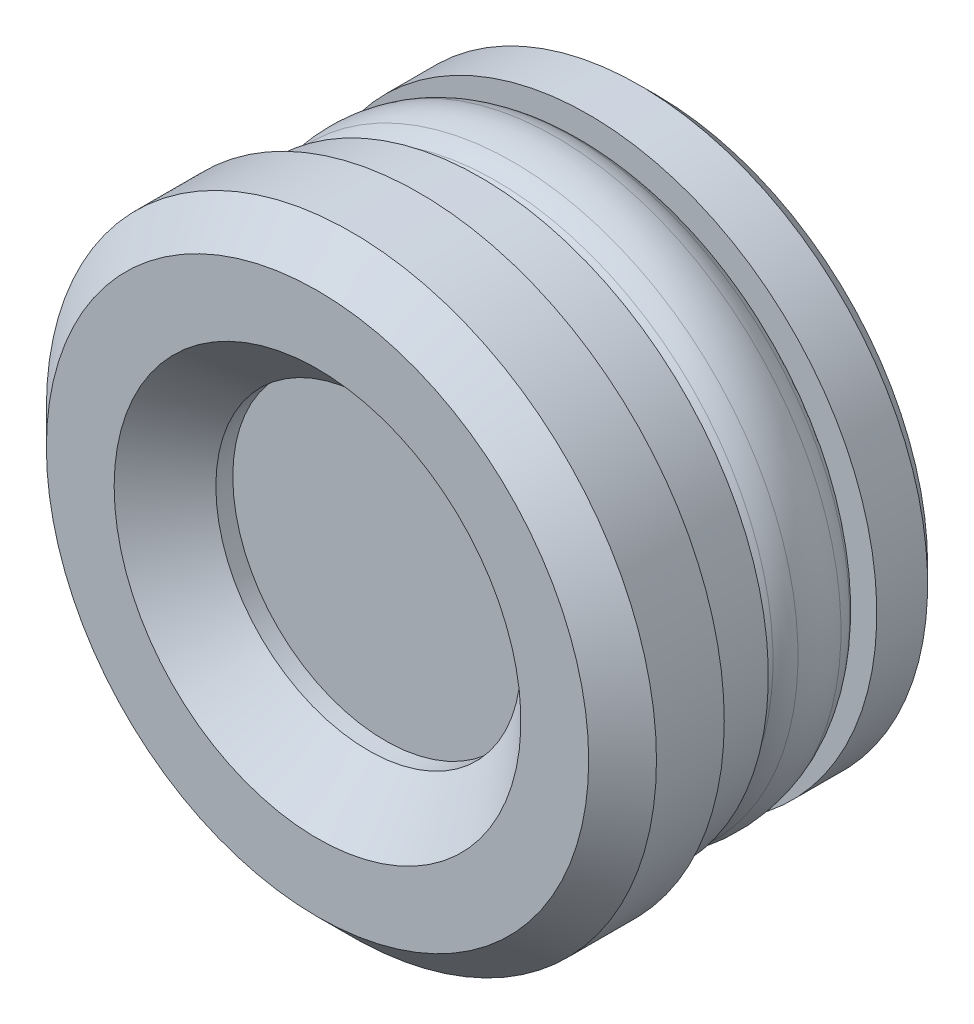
ISO-10303-21;
HEADER;
FILE_DESCRIPTION(('STEP AP214'),'2;1');
FILE_NAME('part.step','',(''),(''),'','','');
FILE_SCHEMA(('AUTOMOTIVE_DESIGN { 1 0 10303 214 1 1 1 1 }'));
ENDSEC;
DATA;
#1=APPLICATION_CONTEXT('core data for automotive mechanical design processes');
#2=APPLICATION_PROTOCOL_DEFINITION('international standard','automotive_design',2000,#1);
#3=PRODUCT_CONTEXT('',#1,'mechanical');
#4=PRODUCT('Part','Part','',(#3));
#5=PRODUCT_RELATED_PRODUCT_CATEGORY('part','',(#4));
#6=PRODUCT_DEFINITION_FORMATION('','',#4);
#7=PRODUCT_DEFINITION_CONTEXT('part definition',#1,'design');
#8=PRODUCT_DEFINITION('design','',#6,#7);
#9=PRODUCT_DEFINITION_SHAPE('','',#8);
#10=(LENGTH_UNIT() NAMED_UNIT(*) SI_UNIT(.MILLI.,.METRE.));
#11=(NAMED_UNIT(*) PLANE_ANGLE_UNIT() SI_UNIT($,.RADIAN.));
#12=(NAMED_UNIT(*) SI_UNIT($,.STERADIAN.) SOLID_ANGLE_UNIT());
#13=UNCERTAINTY_MEASURE_WITH_UNIT(LENGTH_MEASURE(1.E-05),#10,'distance_accuracy_value','');
#14=(GEOMETRIC_REPRESENTATION_CONTEXT(3) GLOBAL_UNCERTAINTY_ASSIGNED_CONTEXT((#13)) GLOBAL_UNIT_ASSIGNED_CONTEXT((#10,
#11,#12)) REPRESENTATION_CONTEXT('',''));
#15=CARTESIAN_POINT('',(0.,0.,0.));
#16=DIRECTION('',(0.,0.,1.));
#17=DIRECTION('',(1.,0.,0.));
#18=AXIS2_PLACEMENT_3D('',#15,#16,#17);
#19=CARTESIAN_POINT('',(0.,0.,-7.3));
#20=DIRECTION('',(0.,0.,1.));
#21=DIRECTION('',(-1.,0.,0.));
#22=AXIS2_PLACEMENT_3D('',#19,#20,#21);
#23=PLANE('',#22);
#24=CARTESIAN_POINT('',(0.,0.,-7.3));
#25=DIRECTION('',(0.,0.,1.));
#26=DIRECTION('',(-1.,0.,0.));
#27=AXIS2_PLACEMENT_3D('',#24,#25,#26);
#28=CIRCLE('',#27,6.75);
#29=CARTESIAN_POINT('',(-6.75,0.,-7.3));
#30=VERTEX_POINT('',#29);
#31=EDGE_CURVE('E70',#30,#30,#28,.T.);
#32=ORIENTED_EDGE('',*,*,#31,.F.);
#33=EDGE_LOOP('',(#32));
#34=FACE_BOUND('',#33,.T.);
#35=ADVANCED_FACE('F12',(#34),#23,.F.);
#36=CARTESIAN_POINT('',(0.,0.,3.));
#37=DIRECTION('',(0.,0.,1.));
#38=DIRECTION('',(-1.,0.,0.));
#39=AXIS2_PLACEMENT_3D('',#36,#37,#38);
#40=PLANE('',#39);
#41=CARTESIAN_POINT('',(0.,0.,3.));
#42=DIRECTION('',(0.,0.,1.));
#43=DIRECTION('',(-1.,0.,0.));
#44=AXIS2_PLACEMENT_3D('',#41,#42,#43);
#45=CIRCLE('',#44,6.);
#46=CARTESIAN_POINT('',(-6.,0.,3.));
#47=VERTEX_POINT('',#46);
#48=EDGE_CURVE('E73',#47,#47,#45,.T.);
#49=ORIENTED_EDGE('',*,*,#48,.F.);
#50=EDGE_LOOP('',(#49));
#51=FACE_BOUND('',#50,.T.);
#52=CARTESIAN_POINT('',(0.,0.,3.));
#53=DIRECTION('',(0.,0.,1.));
#54=DIRECTION('',(-1.,0.,0.));
#55=AXIS2_PLACEMENT_3D('',#52,#53,#54);
#56=CIRCLE('',#55,8.);
#57=CARTESIAN_POINT('',(-8.,0.,3.));
#58=VERTEX_POINT('',#57);
#59=EDGE_CURVE('E8',#58,#58,#56,.T.);
#60=ORIENTED_EDGE('',*,*,#59,.T.);
#61=EDGE_LOOP('',(#60));
#62=FACE_BOUND('',#61,.T.);
#63=ADVANCED_FACE('F98',(#51,#62),#40,.T.);
#64=CARTESIAN_POINT('',(0.,0.,3.));
#65=DIRECTION('',(0.,0.,-1.));
#66=DIRECTION('',(1.,0.,0.));
#67=AXIS2_PLACEMENT_3D('',#64,#65,#66);
#68=CONICAL_SURFACE('',#67,8.,0.785398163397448);
#69=CARTESIAN_POINT('',(0.,0.,2.));
#70=DIRECTION('',(0.,0.,1.));
#71=DIRECTION('',(-1.,0.,0.));
#72=AXIS2_PLACEMENT_3D('',#69,#70,#71);
#73=CIRCLE('',#72,9.);
#74=CARTESIAN_POINT('',(-9.,0.,2.));
#75=VERTEX_POINT('',#74);
#76=EDGE_CURVE('E18',#75,#75,#73,.T.);
#77=ORIENTED_EDGE('',*,*,#76,.T.);
#78=EDGE_LOOP('',(#77));
#79=FACE_BOUND('',#78,.T.);
#80=ORIENTED_EDGE('',*,*,#59,.F.);
#81=EDGE_LOOP('',(#80));
#82=FACE_BOUND('',#81,.T.);
#83=ADVANCED_FACE('F100',(#79,#82),#68,.T.);
#84=CARTESIAN_POINT('',(0.,0.,8.8491629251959));
#85=DIRECTION('',(0.,0.,1.));
#86=DIRECTION('',(-1.,0.,0.));
#87=AXIS2_PLACEMENT_3D('',#84,#85,#86);
#88=CYLINDRICAL_SURFACE('',#87,9.);
#89=CARTESIAN_POINT('',(0.,0.,0.));
#90=DIRECTION('',(0.,0.,1.));
#91=DIRECTION('',(-1.,0.,0.));
#92=AXIS2_PLACEMENT_3D('',#89,#90,#91);
#93=CIRCLE('',#92,9.);
#94=CARTESIAN_POINT('',(-9.,0.,0.));
#95=VERTEX_POINT('',#94);
#96=EDGE_CURVE('E22',#95,#95,#93,.T.);
#97=ORIENTED_EDGE('',*,*,#96,.T.);
#98=EDGE_LOOP('',(#97));
#99=FACE_BOUND('',#98,.T.);
#100=ORIENTED_EDGE('',*,*,#76,.F.);
#101=EDGE_LOOP('',(#100));
#102=FACE_BOUND('',#101,.T.);
#103=ADVANCED_FACE('F107',(#99,#102),#88,.T.);
#104=CARTESIAN_POINT('',(0.,-8.5,0.));
#105=DIRECTION('',(0.,0.,1.));
#106=DIRECTION('',(-1.,0.,0.));
#107=AXIS2_PLACEMENT_3D('',#104,#105,#106);
#108=PLANE('',#107);
#109=ORIENTED_EDGE('',*,*,#96,.F.);
#110=EDGE_LOOP('',(#109));
#111=FACE_BOUND('',#110,.T.);
#112=CARTESIAN_POINT('',(0.,0.,0.));
#113=DIRECTION('',(0.,0.,1.));
#114=DIRECTION('',(-1.,0.,0.));
#115=AXIS2_PLACEMENT_3D('',#112,#113,#114);
#116=CIRCLE('',#115,8.5);
#117=CARTESIAN_POINT('',(-8.5,0.,0.));
#118=VERTEX_POINT('',#117);
#119=EDGE_CURVE('E26',#118,#118,#116,.T.);
#120=ORIENTED_EDGE('',*,*,#119,.T.);
#121=EDGE_LOOP('',(#120));
#122=FACE_BOUND('',#121,.T.);
#123=ADVANCED_FACE('F113',(#111,#122),#108,.F.);
#124=CARTESIAN_POINT('',(0.,0.,8.8491629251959));
#125=DIRECTION('',(0.,0.,1.));
#126=DIRECTION('',(-1.,0.,0.));
#127=AXIS2_PLACEMENT_3D('',#124,#125,#126);
#128=CYLINDRICAL_SURFACE('',#127,8.5);
#129=ORIENTED_EDGE('',*,*,#119,.F.);
#130=EDGE_LOOP('',(#129));
#131=FACE_BOUND('',#130,.T.);
#132=CARTESIAN_POINT('',(0.,0.,-1.8));
#133=DIRECTION('',(0.,0.,1.));
#134=DIRECTION('',(-1.,0.,0.));
#135=AXIS2_PLACEMENT_3D('',#132,#133,#134);
#136=CIRCLE('',#135,8.5);
#137=CARTESIAN_POINT('',(-8.5,0.,-1.8));
#138=VERTEX_POINT('',#137);
#139=EDGE_CURVE('E31',#138,#138,#136,.T.);
#140=ORIENTED_EDGE('',*,*,#139,.T.);
#141=EDGE_LOOP('',(#140));
#142=FACE_BOUND('',#141,.T.);
#143=ADVANCED_FACE('F117',(#131,#142),#128,.T.);
#144=CARTESIAN_POINT('',(0.,-7.375,-1.79999999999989));
#145=DIRECTION('',(0.,0.,1.));
#146=DIRECTION('',(-1.,0.,0.));
#147=AXIS2_PLACEMENT_3D('',#144,#145,#146);
#148=PLANE('',#147);
#149=ORIENTED_EDGE('',*,*,#139,.F.);
#150=EDGE_LOOP('',(#149));
#151=FACE_BOUND('',#150,.T.);
#152=CARTESIAN_POINT('',(0.,0.,-1.79999999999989));
#153=DIRECTION('',(0.,0.,1.));
#154=DIRECTION('',(-1.,0.,0.));
#155=AXIS2_PLACEMENT_3D('',#152,#153,#154);
#156=CIRCLE('',#155,7.375);
#157=CARTESIAN_POINT('',(-7.375,0.,-1.79999999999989));
#158=VERTEX_POINT('',#157);
#159=EDGE_CURVE('E34',#158,#158,#156,.T.);
#160=ORIENTED_EDGE('',*,*,#159,.T.);
#161=EDGE_LOOP('',(#160));
#162=FACE_BOUND('',#161,.T.);
#163=ADVANCED_FACE('F121',(#151,#162),#148,.F.);
#164=CARTESIAN_POINT('',(0.,0.,-2.60419839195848));
#165=DIRECTION('',(0.,0.,1.));
#166=DIRECTION('',(-1.,0.,0.));
#167=AXIS2_PLACEMENT_3D('',#164,#165,#166);
#168=TOROIDAL_SURFACE('',#167,7.375,0.804198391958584);
#169=CARTESIAN_POINT('',(0.,0.,-1.9112953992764));
#170=DIRECTION('',(0.,0.,1.));
#171=DIRECTION('',(-1.,0.,0.));
#172=AXIS2_PLACEMENT_3D('',#169,#170,#171);
#173=CIRCLE('',#172,7.78319173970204);
#174=CARTESIAN_POINT('',(-7.78319173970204,0.,-1.9112953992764));
#175=VERTEX_POINT('',#174);
#176=EDGE_CURVE('E37',#175,#175,#173,.T.);
#177=ORIENTED_EDGE('',*,*,#176,.T.);
#178=EDGE_LOOP('',(#177));
#179=FACE_BOUND('',#178,.T.);
#180=ORIENTED_EDGE('',*,*,#159,.F.);
#181=EDGE_LOOP('',(#180));
#182=FACE_BOUND('',#181,.T.);
#183=ADVANCED_FACE('F125',(#179,#182),#168,.T.);
#184=CARTESIAN_POINT('',(0.,0.,-2.9861861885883));
#185=DIRECTION('',(0.,0.,1.));
#186=DIRECTION('',(-1.,0.,0.));
#187=AXIS2_PLACEMENT_3D('',#184,#185,#186);
#188=TOROIDAL_SURFACE('',#187,7.14996956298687,1.24754179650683);
#189=CARTESIAN_POINT('',(0.,0.,-2.2686291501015));
#190=DIRECTION('',(0.,0.,1.));
#191=DIRECTION('',(-1.,0.,0.));
#192=AXIS2_PLACEMENT_3D('',#189,#190,#191);
#193=CIRCLE('',#192,8.1704951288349);
#194=CARTESIAN_POINT('',(-8.1704951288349,0.,-2.2686291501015));
#195=VERTEX_POINT('',#194);
#196=EDGE_CURVE('E40',#195,#195,#193,.T.);
#197=ORIENTED_EDGE('',*,*,#196,.T.);
#198=EDGE_LOOP('',(#197));
#199=FACE_BOUND('',#198,.T.);
#200=ORIENTED_EDGE('',*,*,#176,.F.);
#201=EDGE_LOOP('',(#200));
#202=FACE_BOUND('',#201,.T.);
#203=ADVANCED_FACE('F129',(#199,#202),#188,.T.);
#204=CARTESIAN_POINT('',(0.,0.,-3.2363346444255));
#205=DIRECTION('',(0.,0.,1.));
#206=DIRECTION('',(-1.,0.,0.));
#207=AXIS2_PLACEMENT_3D('',#204,#205,#206);
#208=TOROIDAL_SURFACE('',#207,6.79420287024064,1.68244890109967);
#209=CARTESIAN_POINT('',(0.,0.,-2.76587834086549));
#210=DIRECTION('',(0.,0.,1.));
#211=DIRECTION('',(-1.,0.,0.));
#212=AXIS2_PLACEMENT_3D('',#209,#210,#211);
#213=CIRCLE('',#212,8.40953725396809);
#214=CARTESIAN_POINT('',(-8.40953725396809,0.,-2.76587834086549));
#215=VERTEX_POINT('',#214);
#216=EDGE_CURVE('E43',#215,#215,#213,.T.);
#217=ORIENTED_EDGE('',*,*,#216,.T.);
#218=EDGE_LOOP('',(#217));
#219=FACE_BOUND('',#218,.T.);
#220=ORIENTED_EDGE('',*,*,#196,.F.);
#221=EDGE_LOOP('',(#220));
#222=FACE_BOUND('',#221,.T.);
#223=ADVANCED_FACE('F133',(#219,#222),#208,.T.);
#224=CARTESIAN_POINT('',(0.,0.,-3.4));
#225=DIRECTION('',(0.,0.,1.));
#226=DIRECTION('',(-1.,0.,0.));
#227=AXIS2_PLACEMENT_3D('',#224,#225,#226);
#228=TOROIDAL_SURFACE('',#227,6.23224998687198,2.26775001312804);
#229=CARTESIAN_POINT('',(0.,0.,-4.03412165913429));
#230=DIRECTION('',(0.,0.,1.));
#231=DIRECTION('',(-1.,0.,0.));
#232=AXIS2_PLACEMENT_3D('',#229,#230,#231);
#233=CIRCLE('',#232,8.40953725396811);
#234=CARTESIAN_POINT('',(-8.40953725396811,0.,-4.03412165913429));
#235=VERTEX_POINT('',#234);
#236=EDGE_CURVE('E46',#235,#235,#233,.T.);
#237=ORIENTED_EDGE('',*,*,#236,.T.);
#238=EDGE_LOOP('',(#237));
#239=FACE_BOUND('',#238,.T.);
#240=ORIENTED_EDGE('',*,*,#216,.F.);
#241=EDGE_LOOP('',(#240));
#242=FACE_BOUND('',#241,.T.);
#243=ADVANCED_FACE('F137',(#239,#242),#228,.T.);
#244=CARTESIAN_POINT('',(0.,0.,-3.5636653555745));
#245=DIRECTION('',(0.,0.,1.));
#246=DIRECTION('',(-1.,0.,0.));
#247=AXIS2_PLACEMENT_3D('',#244,#245,#246);
#248=TOROIDAL_SURFACE('',#247,6.79420287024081,1.68244890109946);
#249=CARTESIAN_POINT('',(0.,0.,-4.53137084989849));
#250=DIRECTION('',(0.,0.,1.));
#251=DIRECTION('',(-1.,0.,0.));
#252=AXIS2_PLACEMENT_3D('',#249,#250,#251);
#253=CIRCLE('',#252,8.1704951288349);
#254=CARTESIAN_POINT('',(-8.1704951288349,0.,-4.53137084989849));
#255=VERTEX_POINT('',#254);
#256=EDGE_CURVE('E49',#255,#255,#253,.T.);
#257=ORIENTED_EDGE('',*,*,#256,.T.);
#258=EDGE_LOOP('',(#257));
#259=FACE_BOUND('',#258,.T.);
#260=ORIENTED_EDGE('',*,*,#236,.F.);
#261=EDGE_LOOP('',(#260));
#262=FACE_BOUND('',#261,.T.);
#263=ADVANCED_FACE('F141',(#259,#262),#248,.T.);
#264=CARTESIAN_POINT('',(0.,0.,-3.81381381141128));
#265=DIRECTION('',(0.,0.,1.));
#266=DIRECTION('',(-1.,0.,0.));
#267=AXIS2_PLACEMENT_3D('',#264,#265,#266);
#268=TOROIDAL_SURFACE('',#267,7.14996956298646,1.24754179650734);
#269=CARTESIAN_POINT('',(0.,0.,-4.8887046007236));
#270=DIRECTION('',(0.,0.,1.));
#271=DIRECTION('',(-1.,0.,0.));
#272=AXIS2_PLACEMENT_3D('',#269,#270,#271);
#273=CIRCLE('',#272,7.78319173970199);
#274=CARTESIAN_POINT('',(-7.78319173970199,0.,-4.8887046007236));
#275=VERTEX_POINT('',#274);
#276=EDGE_CURVE('E52',#275,#275,#273,.T.);
#277=ORIENTED_EDGE('',*,*,#276,.T.);
#278=EDGE_LOOP('',(#277));
#279=FACE_BOUND('',#278,.T.);
#280=ORIENTED_EDGE('',*,*,#256,.F.);
#281=EDGE_LOOP('',(#280));
#282=FACE_BOUND('',#281,.T.);
#283=ADVANCED_FACE('F145',(#279,#282),#268,.T.);
#284=CARTESIAN_POINT('',(0.,0.,-4.19580160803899));
#285=DIRECTION('',(0.,0.,1.));
#286=DIRECTION('',(-1.,0.,0.));
#287=AXIS2_PLACEMENT_3D('',#284,#285,#286);
#288=TOROIDAL_SURFACE('',#287,7.3750000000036,0.804198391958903);
#289=CARTESIAN_POINT('',(0.,0.,-4.9999999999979));
#290=DIRECTION('',(0.,0.,1.));
#291=DIRECTION('',(-1.,0.,0.));
#292=AXIS2_PLACEMENT_3D('',#289,#290,#291);
#293=CIRCLE('',#292,7.375);
#294=CARTESIAN_POINT('',(-7.375,0.,-4.9999999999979));
#295=VERTEX_POINT('',#294);
#296=EDGE_CURVE('E55',#295,#295,#293,.T.);
#297=ORIENTED_EDGE('',*,*,#296,.T.);
#298=EDGE_LOOP('',(#297));
#299=FACE_BOUND('',#298,.T.);
#300=ORIENTED_EDGE('',*,*,#276,.F.);
#301=EDGE_LOOP('',(#300));
#302=FACE_BOUND('',#301,.T.);
#303=ADVANCED_FACE('F149',(#299,#302),#288,.T.);
#304=CARTESIAN_POINT('',(0.,-7.375,-4.9999999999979));
#305=DIRECTION('',(0.,0.,1.));
#306=DIRECTION('',(-1.,0.,0.));
#307=AXIS2_PLACEMENT_3D('',#304,#305,#306);
#308=PLANE('',#307);
#309=CARTESIAN_POINT('',(0.,0.,-5.));
#310=DIRECTION('',(0.,0.,1.));
#311=DIRECTION('',(-1.,0.,0.));
#312=AXIS2_PLACEMENT_3D('',#309,#310,#311);
#313=CIRCLE('',#312,8.5);
#314=CARTESIAN_POINT('',(-8.5,0.,-5.));
#315=VERTEX_POINT('',#314);
#316=EDGE_CURVE('E58',#315,#315,#313,.T.);
#317=ORIENTED_EDGE('',*,*,#316,.T.);
#318=EDGE_LOOP('',(#317));
#319=FACE_BOUND('',#318,.T.);
#320=ORIENTED_EDGE('',*,*,#296,.F.);
#321=EDGE_LOOP('',(#320));
#322=FACE_BOUND('',#321,.T.);
#323=ADVANCED_FACE('F153',(#319,#322),#308,.T.);
#324=CARTESIAN_POINT('',(0.,0.,8.8491629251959));
#325=DIRECTION('',(0.,0.,1.));
#326=DIRECTION('',(-1.,0.,0.));
#327=AXIS2_PLACEMENT_3D('',#324,#325,#326);
#328=CYLINDRICAL_SURFACE('',#327,8.5);
#329=ORIENTED_EDGE('',*,*,#316,.F.);
#330=EDGE_LOOP('',(#329));
#331=FACE_BOUND('',#330,.T.);
#332=CARTESIAN_POINT('',(0.,0.,-6.5));
#333=DIRECTION('',(0.,0.,1.));
#334=DIRECTION('',(-1.,0.,0.));
#335=AXIS2_PLACEMENT_3D('',#332,#333,#334);
#336=CIRCLE('',#335,8.5);
#337=CARTESIAN_POINT('',(-8.5,0.,-6.5));
#338=VERTEX_POINT('',#337);
#339=EDGE_CURVE('E61',#338,#338,#336,.T.);
#340=ORIENTED_EDGE('',*,*,#339,.T.);
#341=EDGE_LOOP('',(#340));
#342=FACE_BOUND('',#341,.T.);
#343=ADVANCED_FACE('F157',(#331,#342),#328,.T.);
#344=CARTESIAN_POINT('',(0.,0.,-7.));
#345=DIRECTION('',(0.,0.,1.));
#346=DIRECTION('',(-1.,0.,0.));
#347=AXIS2_PLACEMENT_3D('',#344,#345,#346);
#348=CONICAL_SURFACE('',#347,8.,0.785398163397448);
#349=ORIENTED_EDGE('',*,*,#339,.F.);
#350=EDGE_LOOP('',(#349));
#351=FACE_BOUND('',#350,.T.);
#352=CARTESIAN_POINT('',(0.,0.,-7.));
#353=DIRECTION('',(0.,0.,1.));
#354=DIRECTION('',(-1.,0.,0.));
#355=AXIS2_PLACEMENT_3D('',#352,#353,#354);
#356=CIRCLE('',#355,8.);
#357=CARTESIAN_POINT('',(-8.,0.,-7.));
#358=VERTEX_POINT('',#357);
#359=EDGE_CURVE('E64',#358,#358,#356,.T.);
#360=ORIENTED_EDGE('',*,*,#359,.T.);
#361=EDGE_LOOP('',(#360));
#362=FACE_BOUND('',#361,.T.);
#363=ADVANCED_FACE('F161',(#351,#362),#348,.T.);
#364=CARTESIAN_POINT('',(0.,-6.75,-7.));
#365=DIRECTION('',(0.,0.,1.));
#366=DIRECTION('',(-1.,0.,0.));
#367=AXIS2_PLACEMENT_3D('',#364,#365,#366);
#368=PLANE('',#367);
#369=ORIENTED_EDGE('',*,*,#359,.F.);
#370=EDGE_LOOP('',(#369));
#371=FACE_BOUND('',#370,.T.);
#372=CARTESIAN_POINT('',(0.,0.,-7.));
#373=DIRECTION('',(0.,0.,1.));
#374=DIRECTION('',(-1.,0.,0.));
#375=AXIS2_PLACEMENT_3D('',#372,#373,#374);
#376=CIRCLE('',#375,6.75);
#377=CARTESIAN_POINT('',(-6.75,0.,-7.));
#378=VERTEX_POINT('',#377);
#379=EDGE_CURVE('E67',#378,#378,#376,.T.);
#380=ORIENTED_EDGE('',*,*,#379,.T.);
#381=EDGE_LOOP('',(#380));
#382=FACE_BOUND('',#381,.T.);
#383=ADVANCED_FACE('F165',(#371,#382),#368,.F.);
#384=CARTESIAN_POINT('',(0.,0.,8.8491629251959));
#385=DIRECTION('',(0.,0.,1.));
#386=DIRECTION('',(-1.,0.,0.));
#387=AXIS2_PLACEMENT_3D('',#384,#385,#386);
#388=CYLINDRICAL_SURFACE('',#387,6.75);
#389=ORIENTED_EDGE('',*,*,#31,.T.);
#390=EDGE_LOOP('',(#389));
#391=FACE_BOUND('',#390,.T.);
#392=ORIENTED_EDGE('',*,*,#379,.F.);
#393=EDGE_LOOP('',(#392));
#394=FACE_BOUND('',#393,.T.);
#395=ADVANCED_FACE('F94',(#391,#394),#388,.T.);
#396=CARTESIAN_POINT('',(0.,0.,3.));
#397=DIRECTION('',(0.,0.,1.));
#398=DIRECTION('',(-1.,0.,0.));
#399=AXIS2_PLACEMENT_3D('',#396,#397,#398);
#400=CONICAL_SURFACE('',#399,6.,0.785398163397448);
#401=CARTESIAN_POINT('',(0.,0.,1.5));
#402=DIRECTION('',(0.,0.,1.));
#403=DIRECTION('',(-1.,0.,0.));
#404=AXIS2_PLACEMENT_3D('',#401,#402,#403);
#405=CIRCLE('',#404,4.5);
#406=CARTESIAN_POINT('',(-4.5,0.,1.5));
#407=VERTEX_POINT('',#406);
#408=EDGE_CURVE('E76',#407,#407,#405,.T.);
#409=ORIENTED_EDGE('',*,*,#408,.F.);
#410=EDGE_LOOP('',(#409));
#411=FACE_BOUND('',#410,.T.);
#412=ORIENTED_EDGE('',*,*,#48,.T.);
#413=EDGE_LOOP('',(#412));
#414=FACE_BOUND('',#413,.T.);
#415=ADVANCED_FACE('F88',(#411,#414),#400,.F.);
#416=CARTESIAN_POINT('',(0.,0.,8.8491629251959));
#417=DIRECTION('',(0.,0.,1.));
#418=DIRECTION('',(-1.,0.,0.));
#419=AXIS2_PLACEMENT_3D('',#416,#417,#418);
#420=CYLINDRICAL_SURFACE('',#419,4.5);
#421=CARTESIAN_POINT('',(0.,0.,1.));
#422=DIRECTION('',(0.,0.,1.));
#423=DIRECTION('',(-1.,0.,0.));
#424=AXIS2_PLACEMENT_3D('',#421,#422,#423);
#425=CIRCLE('',#424,4.5);
#426=CARTESIAN_POINT('',(-4.5,0.,1.));
#427=VERTEX_POINT('',#426);
#428=EDGE_CURVE('E79',#427,#427,#425,.T.);
#429=ORIENTED_EDGE('',*,*,#428,.F.);
#430=EDGE_LOOP('',(#429));
#431=FACE_BOUND('',#430,.T.);
#432=ORIENTED_EDGE('',*,*,#408,.T.);
#433=EDGE_LOOP('',(#432));
#434=FACE_BOUND('',#433,.T.);
#435=ADVANCED_FACE('F85',(#431,#434),#420,.F.);
#436=CARTESIAN_POINT('',(0.,-4.5,1.));
#437=DIRECTION('',(0.,0.,-1.));
#438=DIRECTION('',(1.,0.,0.));
#439=AXIS2_PLACEMENT_3D('',#436,#437,#438);
#440=PLANE('',#439);
#441=ORIENTED_EDGE('',*,*,#428,.T.);
#442=EDGE_LOOP('',(#441));
#443=FACE_BOUND('',#442,.T.);
#444=ADVANCED_FACE('F83',(#443),#440,.F.);
#445=CLOSED_SHELL('',(#35,#63,#83,#103,#123,#143,#163,#183,#203,#223,#243,#263,#283,#303,#323,
#343,#363,#383,#395,#415,#435,#444));
#446=MANIFOLD_SOLID_BREP('B1',#445);
#447=ADVANCED_BREP_SHAPE_REPRESENTATION('',(#18,#446),#14);
#448=SHAPE_DEFINITION_REPRESENTATION(#9,#447);
ENDSEC;
END-ISO-10303-21;
